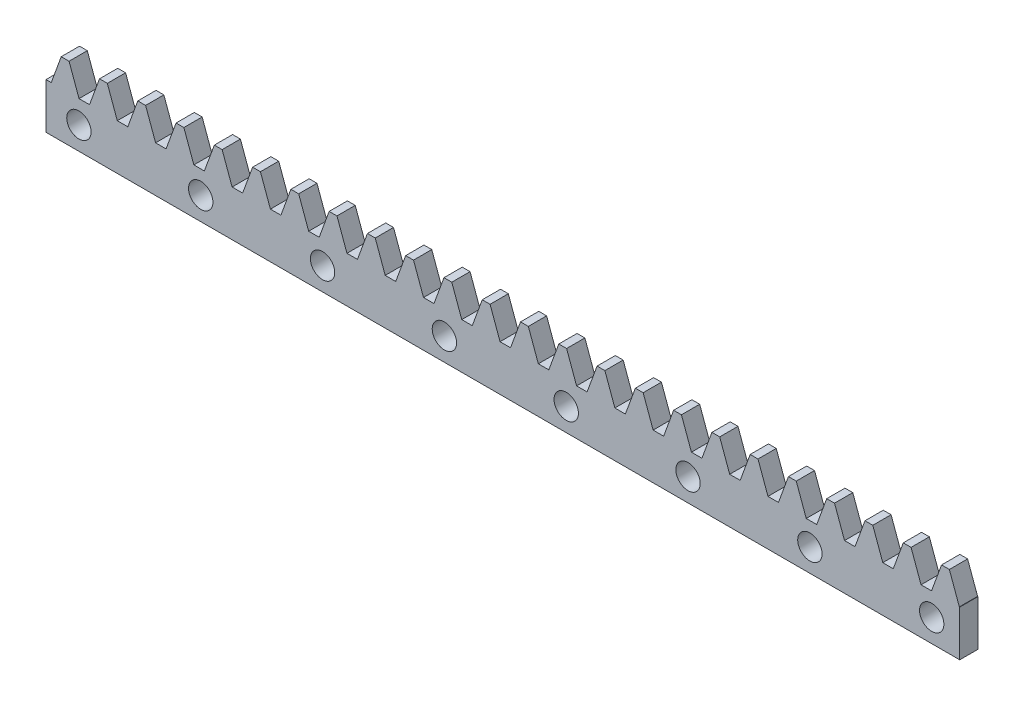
from build123d import *

# Parameters (mm, degrees)
EXTRUDE_1_DEPTH          = 3
CUT_EXTRUDE_1_DEPTH      = 21
CUT_EXTRUDE_1_DEPTH_BACK = 10
SKETCH_3_R               = 2


with BuildPart() as part:
    # Sketch 1 → Extrude 1 (new body)
    with BuildSketch(Plane.XY):
        Polygon((150, 7.5), (149.934576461, 7.5), (148.296710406, 12), (147.012998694, 12), (145.375132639, 7.5), (143.651391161, 7.5), (142.013525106, 12), (140.729813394, 12), (139.091947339, 7.5), (137.368205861, 7.5), (135.730339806, 12), (134.446628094, 12), (132.808762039, 7.5), (131.085020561, 7.5), (129.447154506, 12), (128.163442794, 12), (126.525576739, 7.5), (124.801835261, 7.5), (123.163969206, 12), (121.880257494, 12), (120.242391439, 7.5), (118.518649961, 7.5), (116.880783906, 12), (115.597072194, 12), (113.959206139, 7.5), (112.235464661, 7.5), (110.597598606, 12), (109.313886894, 12), (107.676020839, 7.5), (105.952279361, 7.5), (104.314413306, 12), (103.030701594, 12), (101.392835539, 7.5), (99.669094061, 7.5), (98.031228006, 12), (96.747516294, 12), (95.109650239, 7.5), (93.385908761, 7.5), (91.748042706, 12), (90.464330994, 12), (88.826464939, 7.5), (87.102723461, 7.5), (85.464857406, 12), (84.181145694, 12), (82.543279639, 7.5), (80.819538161, 7.5), (79.181672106, 12), (77.897960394, 12), (76.260094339, 7.5), (74.536352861, 7.5), (72.898486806, 12), (71.614775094, 12), (69.976909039, 7.5), (68.253167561, 7.5), (66.615301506, 12), (65.331589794, 12), (63.693723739, 7.5), (61.969982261, 7.5), (60.332116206, 12), (59.048404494, 12), (57.410538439, 7.5), (55.686796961, 7.5), (54.048930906, 12), (52.765219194, 12), (51.127353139, 7.5), (49.403611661, 7.5), (47.765745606, 12), (46.482033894, 12), (44.844167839, 7.5), (43.120426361, 7.5), (41.482560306, 12), (40.198848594, 12), (38.560982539, 7.5), (36.837241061, 7.5), (35.199375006, 12), (33.915663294, 12), (32.277797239, 7.5), (30.554055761, 7.5), (28.916189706, 12), (27.632477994, 12), (25.994611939, 7.5), (24.270870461, 7.5), (22.633004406, 12), (21.349292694, 12), (19.711426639, 7.5), (17.987685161, 7.5), (16.349819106, 12), (15.066107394, 12), (13.428241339, 7.5), (11.704499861, 7.5), (10.066633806, 12), (8.782922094, 12), (7.145056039, 7.5), (5.421314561, 7.5), (3.783448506, 12), (2.499736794, 12), (0.861870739, 7.5), (0, 7.5), (0, 0), (150, 0), align=None)
    extrude(amount=EXTRUDE_1_DEPTH)

    # Sketch 3 → Cut-Extrude 1 (cut, two sides: drawn at the far end of the back side and taken through both)
    with BuildSketch(Plane.XY.offset(3).offset(-CUT_EXTRUDE_1_DEPTH_BACK)):
        with Locations(Location((5.401073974, 3.75, 0), (0, 0, 180))):
            Circle(SKETCH_3_R)
        with Locations(Location((25.401073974, 3.75, 0), (0, 0, 180))):
            Circle(SKETCH_3_R)
        with Locations(Location((45.401073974, 3.75, 0), (0, 0, 180))):
            Circle(SKETCH_3_R)
        with Locations(Location((65.401073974, 3.75, 0), (0, 0, 180))):
            Circle(SKETCH_3_R)
        with Locations(Location((85.401073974, 3.75, 0), (0, 0, 180))):
            Circle(SKETCH_3_R)
        with Locations(Location((105.401073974, 3.75, 0), (0, 0, 180))):
            Circle(SKETCH_3_R)
        with Locations(Location((125.401073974, 3.75, 0), (0, 0, 180))):
            Circle(SKETCH_3_R)
        with Locations(Location((145.401073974, 3.75, 0), (0, 0, 180))):
            Circle(SKETCH_3_R)
    extrude(amount=CUT_EXTRUDE_1_DEPTH + CUT_EXTRUDE_1_DEPTH_BACK, mode=Mode.SUBTRACT)


solid = part.part
